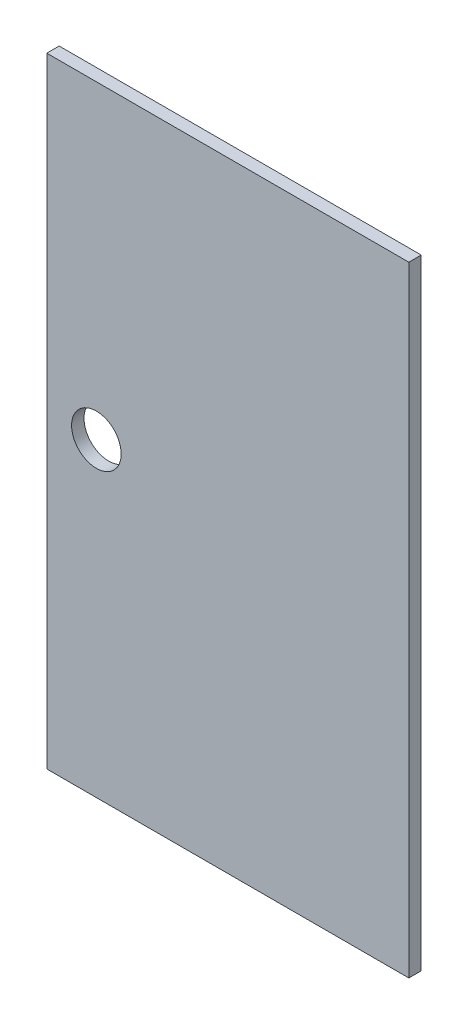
ISO-10303-21;
HEADER;
FILE_DESCRIPTION(('STEP AP214'),'2;1');
FILE_NAME('part.step','',(''),(''),'','','');
FILE_SCHEMA(('AUTOMOTIVE_DESIGN { 1 0 10303 214 1 1 1 1 }'));
ENDSEC;
DATA;
#1=APPLICATION_CONTEXT('core data for automotive mechanical design processes');
#2=APPLICATION_PROTOCOL_DEFINITION('international standard','automotive_design',2000,#1);
#3=PRODUCT_CONTEXT('',#1,'mechanical');
#4=PRODUCT('Part','Part','',(#3));
#5=PRODUCT_RELATED_PRODUCT_CATEGORY('part','',(#4));
#6=PRODUCT_DEFINITION_FORMATION('','',#4);
#7=PRODUCT_DEFINITION_CONTEXT('part definition',#1,'design');
#8=PRODUCT_DEFINITION('design','',#6,#7);
#9=PRODUCT_DEFINITION_SHAPE('','',#8);
#10=(LENGTH_UNIT() NAMED_UNIT(*) SI_UNIT(.MILLI.,.METRE.));
#11=(NAMED_UNIT(*) PLANE_ANGLE_UNIT() SI_UNIT($,.RADIAN.));
#12=(NAMED_UNIT(*) SI_UNIT($,.STERADIAN.) SOLID_ANGLE_UNIT());
#13=UNCERTAINTY_MEASURE_WITH_UNIT(LENGTH_MEASURE(1.E-05),#10,'distance_accuracy_value','');
#14=(GEOMETRIC_REPRESENTATION_CONTEXT(3) GLOBAL_UNCERTAINTY_ASSIGNED_CONTEXT((#13)) GLOBAL_UNIT_ASSIGNED_CONTEXT((#10,
#11,#12)) REPRESENTATION_CONTEXT('',''));
#15=CARTESIAN_POINT('',(0.,0.,0.));
#16=DIRECTION('',(0.,0.,1.));
#17=DIRECTION('',(1.,0.,0.));
#18=AXIS2_PLACEMENT_3D('',#15,#16,#17);
#19=CARTESIAN_POINT('',(146.,500.,5.));
#20=DIRECTION('',(-1.,0.,0.));
#21=DIRECTION('',(0.,0.,1.));
#22=AXIS2_PLACEMENT_3D('',#19,#20,#21);
#23=PLANE('',#22);
#24=DIRECTION('',(0.,0.,-1.));
#25=VECTOR('',#24,1.);
#26=CARTESIAN_POINT('',(146.,0.,5.));
#27=LINE('',#26,#25);
#28=CARTESIAN_POINT('',(146.,0.,5.));
#29=VERTEX_POINT('',#28);
#30=CARTESIAN_POINT('',(146.,0.,-5.));
#31=VERTEX_POINT('',#30);
#32=EDGE_CURVE('E95',#29,#31,#27,.T.);
#33=ORIENTED_EDGE('',*,*,#32,.T.);
#34=DIRECTION('',(0.,-1.,0.));
#35=VECTOR('',#34,1.);
#36=CARTESIAN_POINT('',(146.,500.,-5.));
#37=LINE('',#36,#35);
#38=CARTESIAN_POINT('',(146.,500.,-5.));
#39=VERTEX_POINT('',#38);
#40=EDGE_CURVE('E11',#39,#31,#37,.T.);
#41=ORIENTED_EDGE('',*,*,#40,.F.);
#42=DIRECTION('',(0.,0.,-1.));
#43=VECTOR('',#42,1.);
#44=CARTESIAN_POINT('',(146.,500.,5.));
#45=LINE('',#44,#43);
#46=CARTESIAN_POINT('',(146.,500.,5.));
#47=VERTEX_POINT('',#46);
#48=EDGE_CURVE('E83',#47,#39,#45,.T.);
#49=ORIENTED_EDGE('',*,*,#48,.F.);
#50=DIRECTION('',(0.,-1.,0.));
#51=VECTOR('',#50,1.);
#52=CARTESIAN_POINT('',(146.,500.,5.));
#53=LINE('',#52,#51);
#54=EDGE_CURVE('E91',#47,#29,#53,.T.);
#55=ORIENTED_EDGE('',*,*,#54,.T.);
#56=EDGE_LOOP('',(#33,#41,#49,#55));
#57=FACE_BOUND('',#56,.T.);
#58=ADVANCED_FACE('F32',(#57),#23,.F.);
#59=CARTESIAN_POINT('',(-146.,500.,-5.));
#60=DIRECTION('',(0.,0.,1.));
#61=DIRECTION('',(1.,0.,0.));
#62=AXIS2_PLACEMENT_3D('',#59,#60,#61);
#63=PLANE('',#62);
#64=CARTESIAN_POINT('',(-106.,250.,-5.));
#65=DIRECTION('',(0.,0.,1.));
#66=DIRECTION('',(1.,0.,0.));
#67=AXIS2_PLACEMENT_3D('',#64,#65,#66);
#68=CIRCLE('',#67,20.);
#69=CARTESIAN_POINT('',(-86.,250.,-5.));
#70=VERTEX_POINT('',#69);
#71=EDGE_CURVE('E98',#70,#70,#68,.T.);
#72=ORIENTED_EDGE('',*,*,#71,.T.);
#73=EDGE_LOOP('',(#72));
#74=FACE_BOUND('',#73,.T.);
#75=DIRECTION('',(-1.,0.,0.));
#76=VECTOR('',#75,1.);
#77=CARTESIAN_POINT('',(-146.,0.,-5.));
#78=LINE('',#77,#76);
#79=CARTESIAN_POINT('',(-146.,0.,-5.));
#80=VERTEX_POINT('',#79);
#81=EDGE_CURVE('E87',#31,#80,#78,.T.);
#82=ORIENTED_EDGE('',*,*,#81,.T.);
#83=DIRECTION('',(0.,-1.,0.));
#84=VECTOR('',#83,1.);
#85=CARTESIAN_POINT('',(-146.,500.,-5.));
#86=LINE('',#85,#84);
#87=CARTESIAN_POINT('',(-146.,500.,-5.));
#88=VERTEX_POINT('',#87);
#89=EDGE_CURVE('E40',#88,#80,#86,.T.);
#90=ORIENTED_EDGE('',*,*,#89,.F.);
#91=DIRECTION('',(-1.,0.,0.));
#92=VECTOR('',#91,1.);
#93=CARTESIAN_POINT('',(-146.,500.,-5.));
#94=LINE('',#93,#92);
#95=EDGE_CURVE('E78',#39,#88,#94,.T.);
#96=ORIENTED_EDGE('',*,*,#95,.F.);
#97=ORIENTED_EDGE('',*,*,#40,.T.);
#98=EDGE_LOOP('',(#82,#90,#96,#97));
#99=FACE_BOUND('',#98,.T.);
#100=ADVANCED_FACE('F86',(#74,#99),#63,.F.);
#101=CARTESIAN_POINT('',(-146.,500.,5.));
#102=DIRECTION('',(1.,0.,0.));
#103=DIRECTION('',(0.,0.,-1.));
#104=AXIS2_PLACEMENT_3D('',#101,#102,#103);
#105=PLANE('',#104);
#106=DIRECTION('',(0.,0.,1.));
#107=VECTOR('',#106,1.);
#108=CARTESIAN_POINT('',(-146.,0.,5.));
#109=LINE('',#108,#107);
#110=CARTESIAN_POINT('',(-146.,0.,5.));
#111=VERTEX_POINT('',#110);
#112=EDGE_CURVE('E65',#80,#111,#109,.T.);
#113=ORIENTED_EDGE('',*,*,#112,.T.);
#114=DIRECTION('',(0.,-1.,0.));
#115=VECTOR('',#114,1.);
#116=CARTESIAN_POINT('',(-146.,500.,5.));
#117=LINE('',#116,#115);
#118=CARTESIAN_POINT('',(-146.,500.,5.));
#119=VERTEX_POINT('',#118);
#120=EDGE_CURVE('E88',#119,#111,#117,.T.);
#121=ORIENTED_EDGE('',*,*,#120,.F.);
#122=DIRECTION('',(0.,0.,1.));
#123=VECTOR('',#122,1.);
#124=CARTESIAN_POINT('',(-146.,500.,5.));
#125=LINE('',#124,#123);
#126=EDGE_CURVE('E81',#88,#119,#125,.T.);
#127=ORIENTED_EDGE('',*,*,#126,.F.);
#128=ORIENTED_EDGE('',*,*,#89,.T.);
#129=EDGE_LOOP('',(#113,#121,#127,#128));
#130=FACE_BOUND('',#129,.T.);
#131=ADVANCED_FACE('F89',(#130),#105,.F.);
#132=CARTESIAN_POINT('',(-146.,500.,5.));
#133=DIRECTION('',(0.,0.,-1.));
#134=DIRECTION('',(-1.,0.,0.));
#135=AXIS2_PLACEMENT_3D('',#132,#133,#134);
#136=PLANE('',#135);
#137=CARTESIAN_POINT('',(-106.,250.,5.));
#138=DIRECTION('',(0.,0.,1.));
#139=DIRECTION('',(1.,0.,0.));
#140=AXIS2_PLACEMENT_3D('',#137,#138,#139);
#141=CIRCLE('',#140,20.);
#142=CARTESIAN_POINT('',(-86.,250.,5.));
#143=VERTEX_POINT('',#142);
#144=EDGE_CURVE('E111',#143,#143,#141,.T.);
#145=ORIENTED_EDGE('',*,*,#144,.F.);
#146=EDGE_LOOP('',(#145));
#147=FACE_BOUND('',#146,.T.);
#148=DIRECTION('',(1.,0.,0.));
#149=VECTOR('',#148,1.);
#150=CARTESIAN_POINT('',(-146.,0.,5.));
#151=LINE('',#150,#149);
#152=EDGE_CURVE('E71',#111,#29,#151,.T.);
#153=ORIENTED_EDGE('',*,*,#152,.T.);
#154=ORIENTED_EDGE('',*,*,#54,.F.);
#155=DIRECTION('',(1.,0.,0.));
#156=VECTOR('',#155,1.);
#157=CARTESIAN_POINT('',(-146.,500.,5.));
#158=LINE('',#157,#156);
#159=EDGE_CURVE('E48',#119,#47,#158,.T.);
#160=ORIENTED_EDGE('',*,*,#159,.F.);
#161=ORIENTED_EDGE('',*,*,#120,.T.);
#162=EDGE_LOOP('',(#153,#154,#160,#161));
#163=FACE_BOUND('',#162,.T.);
#164=ADVANCED_FACE('F103',(#147,#163),#136,.F.);
#165=CARTESIAN_POINT('',(0.,500.,0.));
#166=DIRECTION('',(0.,-1.,0.));
#167=DIRECTION('',(0.,0.,-1.));
#168=AXIS2_PLACEMENT_3D('',#165,#166,#167);
#169=PLANE('',#168);
#170=ORIENTED_EDGE('',*,*,#48,.T.);
#171=ORIENTED_EDGE('',*,*,#95,.T.);
#172=ORIENTED_EDGE('',*,*,#126,.T.);
#173=ORIENTED_EDGE('',*,*,#159,.T.);
#174=EDGE_LOOP('',(#170,#171,#172,#173));
#175=FACE_BOUND('',#174,.T.);
#176=ADVANCED_FACE('F79',(#175),#169,.F.);
#177=CARTESIAN_POINT('',(0.,0.,0.));
#178=DIRECTION('',(0.,-1.,0.));
#179=DIRECTION('',(0.,0.,-1.));
#180=AXIS2_PLACEMENT_3D('',#177,#178,#179);
#181=PLANE('',#180);
#182=ORIENTED_EDGE('',*,*,#32,.F.);
#183=ORIENTED_EDGE('',*,*,#152,.F.);
#184=ORIENTED_EDGE('',*,*,#112,.F.);
#185=ORIENTED_EDGE('',*,*,#81,.F.);
#186=EDGE_LOOP('',(#182,#183,#184,#185));
#187=FACE_BOUND('',#186,.T.);
#188=ADVANCED_FACE('F106',(#187),#181,.T.);
#189=CARTESIAN_POINT('',(-106.,250.,-266.));
#190=DIRECTION('',(0.,0.,1.));
#191=DIRECTION('',(1.,0.,0.));
#192=AXIS2_PLACEMENT_3D('',#189,#190,#191);
#193=CYLINDRICAL_SURFACE('',#192,20.);
#194=ORIENTED_EDGE('',*,*,#144,.T.);
#195=EDGE_LOOP('',(#194));
#196=FACE_BOUND('',#195,.T.);
#197=ORIENTED_EDGE('',*,*,#71,.F.);
#198=EDGE_LOOP('',(#197));
#199=FACE_BOUND('',#198,.T.);
#200=ADVANCED_FACE('F115',(#196,#199),#193,.F.);
#201=CLOSED_SHELL('',(#58,#100,#131,#164,#176,#188,#200));
#202=MANIFOLD_SOLID_BREP('B2',#201);
#203=ADVANCED_BREP_SHAPE_REPRESENTATION('',(#18,#202),#14);
#204=SHAPE_DEFINITION_REPRESENTATION(#9,#203);
ENDSEC;
END-ISO-10303-21;
